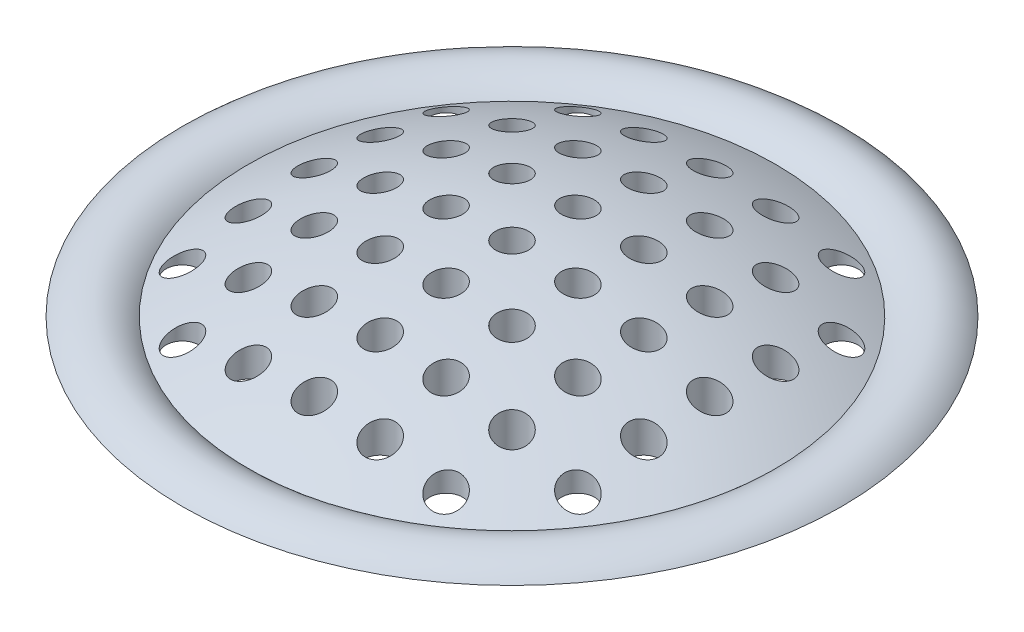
from build123d import *

# Parameters (mm, degrees)
SCHIZZO2_R               = 0.5
TAGLIO_ESTRUSIONE1_DEPTH = 2


with BuildPart() as part:
    # Schizzo1 → Rivoluzione1 (revolve)
    with BuildSketch(Plane.XY):
        with BuildLine():
            ThreePointArc((-8, 0), (-9, 0.414213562), (-10, 0))
            Line((-10, 0), (-8, 0))
        make_face()
        with BuildLine():
            ThreePointArc((0, 2), (-4.123105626, 1.492422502), (-8, 0))
            Line((-8, 0), (0, 0))
            Line((0, 0), (0, 2))
        make_face()
    revolve(axis=Axis((0, 0, 0), (0, 1, 0)))

    # Schizzo2 → Taglio-Estrusione1 (cut)
    with BuildSketch(Plane(origin=(0, 0, 0), x_dir=(1, 0, 0), z_dir=(0, 1, 0))):
        with Locations(Location((-4, 6, 0), (0, 0, 135.952337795))):
            Circle(SCHIZZO2_R)
        with Locations(Location((-2, 6, 0), (0, 0, 138.100875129))):
            Circle(SCHIZZO2_R)
        with Locations(Location((0, 6, 0), (0, 0, 90))):
            Circle(SCHIZZO2_R)
        with Locations(Location((2, 6, 0), (0, 0, 137.411298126))):
            Circle(SCHIZZO2_R)
        with Locations(Location((4, 6, 0), (0, 0, 131.20094573))):
            Circle(SCHIZZO2_R)
        with Locations(Location((-6, 4, 0), (0, 0, 134.047662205))):
            Circle(SCHIZZO2_R)
        with Locations(Location((-4, 4, 0), (0, 0, 135))):
            Circle(SCHIZZO2_R)
        with Locations(Location((-2, 4, 0), (0, 0, 134.868155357))):
            Circle(SCHIZZO2_R)
        with Locations(Location((0, 4, 0), (0, 0, 270.000000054))):
            Circle(SCHIZZO2_R)
        with Locations(Location((2, 4, 0), (0, 0, 132.328990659))):
            Circle(SCHIZZO2_R)
        with Locations(Location((4, 4, 0), (0, 0, 125.545827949))):
            Circle(SCHIZZO2_R)
        with Locations(Location((6, 4, 0), (0, 0, 126.968267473))):
            Circle(SCHIZZO2_R)
        with Locations(Location((-6, 2, 0), (0, 0, 144.210948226))):
            Circle(SCHIZZO2_R)
        with Locations(Location((-4, 2, 0), (0, 0, 146.33982336))):
            Circle(SCHIZZO2_R)
        with Locations(Location((-2, 2, 0), (0, 0, 135))):
            Circle(SCHIZZO2_R)
        with Locations(Location((0, 2, 0), (0, 0, 89.999999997))):
            Circle(SCHIZZO2_R)
        with Locations(Location((2, 2, 0), (0, 0, 134.898734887))):
            Circle(SCHIZZO2_R)
        with Locations(Location((4, 2, 0), (0, 0, 129.723056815))):
            Circle(SCHIZZO2_R)
        with Locations(Location((6, 2, 0), (0, 0, 131.01095367))):
            Circle(SCHIZZO2_R)
        with Locations(Location((-6, 0, 0), (0, 0, 146.086673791))):
            Circle(SCHIZZO2_R)
        with Locations(Location((-4, 0, 0), (0, 0, 148.839317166))):
            Circle(SCHIZZO2_R)
        with Locations(Location((-2, 0, 0), (0, 0, 135.751983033))):
            Circle(SCHIZZO2_R)
        with Locations(Location((0, 0, 0), (0, 0, 90))):
            Circle(SCHIZZO2_R)
        with Locations(Location((2, 0, 0), (0, 0, 133.395925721))):
            Circle(SCHIZZO2_R)
        with Locations(Location((4, 0, 0), (0, 0, 137.656688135))):
            Circle(SCHIZZO2_R)
        with Locations(Location((6, 0, 0), (0, 0, 126.682659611))):
            Circle(SCHIZZO2_R)
        with Locations(Location((-6, -2, 0), (0, 0, 142.946947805))):
            Circle(SCHIZZO2_R)
        with Locations(Location((-4, -2, 0), (0, 0, 148.26455103))):
            Circle(SCHIZZO2_R)
        with Locations(Location((-2, -2, 0), (0, 0, 135.101265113))):
            Circle(SCHIZZO2_R)
        with Locations(Location((0, -2, 0), (0, 0, 136.604074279))):
            Circle(SCHIZZO2_R)
        with Locations(Location((2, -2, 0), (0, 0, 135))):
            Circle(SCHIZZO2_R)
        with Locations(Location((4, -2, 0), (0, 0, 132.21359408))):
            Circle(SCHIZZO2_R)
        with Locations(Location((6, -2, 0), (0, 0, 131.01980781))):
            Circle(SCHIZZO2_R)
        with Locations(Location((-6, -4, 0), (0, 0, 148.24823628))):
            Circle(SCHIZZO2_R)
        with Locations(Location((-4, -4, 0), (0, 0, 154.990010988))):
            Circle(SCHIZZO2_R)
        with Locations(Location((-2, -4, 0), (0, 0, 140.276943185))):
            Circle(SCHIZZO2_R)
        with Locations(Location((0, -4, 0), (0, 0, 132.343311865))):
            Circle(SCHIZZO2_R)
        with Locations(Location((2, -4, 0), (0, 0, 137.78640592))):
            Circle(SCHIZZO2_R)
        with Locations(Location((4, -4, 0), (0, 0, 234.454172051))):
            Circle(SCHIZZO2_R)
        with Locations(Location((6, -4, 0), (0, 0, 130.93348871))):
            Circle(SCHIZZO2_R)
        with Locations(Location((-4, -6, 0), (0, 0, 152.347222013))):
            Circle(SCHIZZO2_R)
        with Locations(Location((-2, -6, 0), (0, 0, 138.98904633))):
            Circle(SCHIZZO2_R)
        with Locations(Location((0, -6, 0), (0, 0, 143.317340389))):
            Circle(SCHIZZO2_R)
        with Locations(Location((2, -6, 0), (0, 0, 138.98019219))):
            Circle(SCHIZZO2_R)
        with Locations(Location((4, -6, 0), (0, 0, 139.06651129))):
            Circle(SCHIZZO2_R)
    extrude(amount=TAGLIO_ESTRUSIONE1_DEPTH, mode=Mode.SUBTRACT)


solid = part.part
